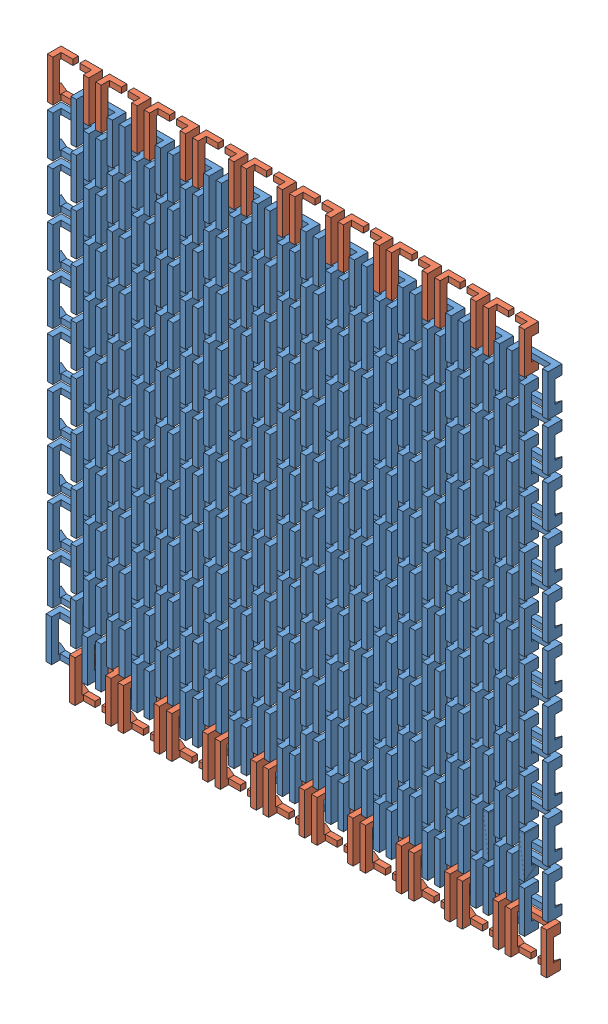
SolidWorks assembly Fabric2withhock.SLDASM, configuration Default (file format 10000). Lengths in mm.
Overall size (72.4 79.42 2.17).
223 component instances, 2 part files, 18 mates.
Components (placement in the parent):
- fabric1-1: fabric1.SLDPRT [Default] at (0.3008 0.4192 2.1343) size (6 6 2)
- fabric1-2: fabric1.SLDPRT [Default] at (-3.0992 3.8192 2.1343) size (6 6 2)
- fabric1-3: fabric1.SLDPRT [Default] at (3.7008 -2.9808 2.1343) size (6 6 2) (suppressed, hidden)
- fabric1-4: fabric1.SLDPRT [Default] at (-3.0992 -2.9808 2.1343) size (6 6 2)
- fabric1-5: fabric1.SLDPRT [Default] at (3.7008 3.8192 2.1343) size (6 6 2) (suppressed, hidden)
- fabric1-6: fabric1.SLDPRT [Default] at (0.3008 7.4192 2.1343) size (6 6 2)
- fabric1-7: fabric1.SLDPRT [Default] at (-6.6992 0.4192 2.1343) size (6 6 2)
- fabric1-8: fabric1.SLDPRT [Default] at (-6.6992 7.4192 2.1343) size (6 6 2)
- fabric1-29: fabric1.SLDPRT [Default] at (0.3008 14.4192 2.1343) size (6 6 2)
- fabric1-30: fabric1.SLDPRT [Default] at (-6.6992 14.4192 2.1343) size (6 6 2)
- fabric1-31: fabric1.SLDPRT [Default] at (-13.6992 0.4192 2.1343) size (6 6 2)
- fabric1-32: fabric1.SLDPRT [Default] at (-13.6992 7.4192 2.1343) size (6 6 2)
- fabric1-33: fabric1.SLDPRT [Default] at (-13.6992 14.4192 2.1343) size (6 6 2)
- fabric1-144: fabric1.SLDPRT [Default] at (0.3008 21.4192 2.1343) size (6 6 2)
- fabric1-145: fabric1.SLDPRT [Default] at (0.3008 28.4192 2.1343) size (6 6 2)
- fabric1-146: fabric1.SLDPRT [Default] at (0.3008 35.4192 2.1343) size (6 6 2)
- fabric1-147: fabric1.SLDPRT [Default] at (0.3008 42.4192 2.1343) size (6 6 2)
- fabric1-148: fabric1.SLDPRT [Default] at (0.3008 49.4192 2.1343) size (6 6 2)
- fabric1-149: fabric1.SLDPRT [Default] at (0.3008 56.4192 2.1343) size (6 6 2)
- fabric1-150: fabric1.SLDPRT [Default] at (0.3008 63.4192 2.1343) size (6 6 2)
- fabric1-151: fabric1.SLDPRT [Default] at (-6.6992 21.4192 2.1343) size (6 6 2)
- fabric1-152: fabric1.SLDPRT [Default] at (-6.6992 28.4192 2.1343) size (6 6 2)
- fabric1-153: fabric1.SLDPRT [Default] at (-6.6992 35.4192 2.1343) size (6 6 2)
- fabric1-154: fabric1.SLDPRT [Default] at (-6.6992 42.4192 2.1343) size (6 6 2)
- fabric1-155: fabric1.SLDPRT [Default] at (-6.6992 49.4192 2.1343) size (6 6 2)
- fabric1-156: fabric1.SLDPRT [Default] at (-6.6992 56.4192 2.1343) size (6 6 2)
- fabric1-157: fabric1.SLDPRT [Default] at (-6.6992 63.4192 2.1343) size (6 6 2)
- fabric1-158: fabric1.SLDPRT [Default] at (-13.6992 21.4192 2.1343) size (6 6 2)
- fabric1-159: fabric1.SLDPRT [Default] at (-13.6992 28.4192 2.1343) size (6 6 2)
- fabric1-160: fabric1.SLDPRT [Default] at (-13.6992 35.4192 2.1343) size (6 6 2)
- fabric1-161: fabric1.SLDPRT [Default] at (-13.6992 42.4192 2.1343) size (6 6 2)
- fabric1-162: fabric1.SLDPRT [Default] at (-13.6992 49.4192 2.1343) size (6 6 2)
- fabric1-163: fabric1.SLDPRT [Default] at (-13.6992 56.4192 2.1343) size (6 6 2)
- fabric1-164: fabric1.SLDPRT [Default] at (-13.6992 63.4192 2.1343) size (6 6 2)
- fabric1-165: fabric1.SLDPRT [Default] at (-20.6992 0.4192 2.1343) size (6 6 2)
- fabric1-166: fabric1.SLDPRT [Default] at (-20.6992 7.4192 2.1343) size (6 6 2)
- fabric1-167: fabric1.SLDPRT [Default] at (-20.6992 14.4192 2.1343) size (6 6 2)
- fabric1-168: fabric1.SLDPRT [Default] at (-20.6992 21.4192 2.1343) size (6 6 2)
- fabric1-169: fabric1.SLDPRT [Default] at (-20.6992 28.4192 2.1343) size (6 6 2)
- fabric1-170: fabric1.SLDPRT [Default] at (-20.6992 35.4192 2.1343) size (6 6 2)
- fabric1-171: fabric1.SLDPRT [Default] at (-20.6992 42.4192 2.1343) size (6 6 2)
- fabric1-172: fabric1.SLDPRT [Default] at (-20.6992 49.4192 2.1343) size (6 6 2)
- fabric1-173: fabric1.SLDPRT [Default] at (-20.6992 56.4192 2.1343) size (6 6 2)
- fabric1-174: fabric1.SLDPRT [Default] at (-20.6992 63.4192 2.1343) size (6 6 2)
- fabric1-175: fabric1.SLDPRT [Default] at (-27.6992 0.4192 2.1343) size (6 6 2)
- fabric1-176: fabric1.SLDPRT [Default] at (-27.6992 7.4192 2.1343) size (6 6 2)
- fabric1-177: fabric1.SLDPRT [Default] at (-27.6992 14.4192 2.1343) size (6 6 2)
- fabric1-178: fabric1.SLDPRT [Default] at (-27.6992 21.4192 2.1343) size (6 6 2)
- fabric1-179: fabric1.SLDPRT [Default] at (-27.6992 28.4192 2.1343) size (6 6 2)
- fabric1-180: fabric1.SLDPRT [Default] at (-27.6992 35.4192 2.1343) size (6 6 2)
- fabric1-181: fabric1.SLDPRT [Default] at (-27.6992 42.4192 2.1343) size (6 6 2)
- fabric1-182: fabric1.SLDPRT [Default] at (-27.6992 49.4192 2.1343) size (6 6 2)
- fabric1-183: fabric1.SLDPRT [Default] at (-27.6992 56.4192 2.1343) size (6 6 2)
- fabric1-184: fabric1.SLDPRT [Default] at (-27.6992 63.4192 2.1343) size (6 6 2)
- fabric1-185: fabric1.SLDPRT [Default] at (-34.6992 0.4192 2.1343) size (6 6 2)
- fabric1-186: fabric1.SLDPRT [Default] at (-34.6992 7.4192 2.1343) size (6 6 2)
- fabric1-187: fabric1.SLDPRT [Default] at (-34.6992 14.4192 2.1343) size (6 6 2)
- fabric1-188: fabric1.SLDPRT [Default] at (-34.6992 21.4192 2.1343) size (6 6 2)
- fabric1-189: fabric1.SLDPRT [Default] at (-34.6992 28.4192 2.1343) size (6 6 2)
- fabric1-190: fabric1.SLDPRT [Default] at (-34.6992 35.4192 2.1343) size (6 6 2)
- fabric1-191: fabric1.SLDPRT [Default] at (-34.6992 42.4192 2.1343) size (6 6 2)
- fabric1-192: fabric1.SLDPRT [Default] at (-34.6992 49.4192 2.1343) size (6 6 2)
- fabric1-193: fabric1.SLDPRT [Default] at (-34.6992 56.4192 2.1343) size (6 6 2)
- fabric1-194: fabric1.SLDPRT [Default] at (-34.6992 63.4192 2.1343) size (6 6 2)
- fabric1-195: fabric1.SLDPRT [Default] at (-41.6992 0.4192 2.1343) size (6 6 2)
- fabric1-196: fabric1.SLDPRT [Default] at (-41.6992 7.4192 2.1343) size (6 6 2)
- fabric1-197: fabric1.SLDPRT [Default] at (-41.6992 14.4192 2.1343) size (6 6 2)
- fabric1-198: fabric1.SLDPRT [Default] at (-41.6992 21.4192 2.1343) size (6 6 2)
- fabric1-199: fabric1.SLDPRT [Default] at (-41.6992 28.4192 2.1343) size (6 6 2)
- fabric1-200: fabric1.SLDPRT [Default] at (-41.6992 35.4192 2.1343) size (6 6 2)
- fabric1-201: fabric1.SLDPRT [Default] at (-41.6992 42.4192 2.1343) size (6 6 2)
- fabric1-202: fabric1.SLDPRT [Default] at (-41.6992 49.4192 2.1343) size (6 6 2)
- fabric1-203: fabric1.SLDPRT [Default] at (-41.6992 56.4192 2.1343) size (6 6 2)
- fabric1-204: fabric1.SLDPRT [Default] at (-41.6992 63.4192 2.1343) size (6 6 2)
- fabric1-205: fabric1.SLDPRT [Default] at (-48.6992 0.4192 2.1343) size (6 6 2)
- fabric1-206: fabric1.SLDPRT [Default] at (-48.6992 7.4192 2.1343) size (6 6 2)
- fabric1-207: fabric1.SLDPRT [Default] at (-48.6992 14.4192 2.1343) size (6 6 2)
- fabric1-208: fabric1.SLDPRT [Default] at (-48.6992 21.4192 2.1343) size (6 6 2)
- fabric1-209: fabric1.SLDPRT [Default] at (-48.6992 28.4192 2.1343) size (6 6 2)
- fabric1-210: fabric1.SLDPRT [Default] at (-48.6992 35.4192 2.1343) size (6 6 2)
- fabric1-211: fabric1.SLDPRT [Default] at (-48.6992 42.4192 2.1343) size (6 6 2)
- fabric1-212: fabric1.SLDPRT [Default] at (-48.6992 49.4192 2.1343) size (6 6 2)
- fabric1-213: fabric1.SLDPRT [Default] at (-48.6992 56.4192 2.1343) size (6 6 2)
- fabric1-214: fabric1.SLDPRT [Default] at (-48.6992 63.4192 2.1343) size (6 6 2)
- fabric1-215: fabric1.SLDPRT [Default] at (-55.6992 0.4192 2.1343) size (6 6 2)
- fabric1-216: fabric1.SLDPRT [Default] at (-55.6992 7.4192 2.1343) size (6 6 2)
- fabric1-217: fabric1.SLDPRT [Default] at (-55.6992 14.4192 2.1343) size (6 6 2)
- fabric1-218: fabric1.SLDPRT [Default] at (-55.6992 21.4192 2.1343) size (6 6 2)
- fabric1-219: fabric1.SLDPRT [Default] at (-55.6992 28.4192 2.1343) size (6 6 2)
- fabric1-220: fabric1.SLDPRT [Default] at (-55.6992 35.4192 2.1343) size (6 6 2)
- fabric1-221: fabric1.SLDPRT [Default] at (-55.6992 42.4192 2.1343) size (6 6 2)
- fabric1-222: fabric1.SLDPRT [Default] at (-55.6992 49.4192 2.1343) size (6 6 2)
- fabric1-223: fabric1.SLDPRT [Default] at (-55.6992 56.4192 2.1343) size (6 6 2)
- fabric1-224: fabric1.SLDPRT [Default] at (-55.6992 63.4192 2.1343) size (6 6 2)
- fabric1-225: fabric1.SLDPRT [Default] at (-62.7187 0.5943 2.1343) size (6 6 2)
- fabric1-226: fabric1.SLDPRT [Default] at (-62.6992 7.4192 2.1343) size (6 6 2)
- fabric1-227: fabric1.SLDPRT [Default] at (-62.6992 14.4192 2.1343) size (6 6 2)
- fabric1-228: fabric1.SLDPRT [Default] at (-62.6992 21.4192 2.1343) size (6 6 2)
- fabric1-229: fabric1.SLDPRT [Default] at (-62.6992 28.4192 2.1343) size (6 6 2)
- fabric1-230: fabric1.SLDPRT [Default] at (-62.6992 35.4192 2.1343) size (6 6 2)
- fabric1-231: fabric1.SLDPRT [Default] at (-62.6992 42.4192 2.1343) size (6 6 2)
- fabric1-232: fabric1.SLDPRT [Default] at (-62.6992 49.4192 2.1343) size (6 6 2)
- fabric1-233: fabric1.SLDPRT [Default] at (-62.6992 56.4192 2.1343) size (6 6 2)
- fabric1-234: fabric1.SLDPRT [Default] at (-62.6992 63.4192 2.1343) size (6 6 2)
- fabric1-963: fabric1.SLDPRT [Default] at (-10.0992 -2.9808 2.1343) size (6 6 2)
- fabric1-964: fabric1.SLDPRT [Default] at (-17.0992 -2.9808 2.1343) size (6 6 2)
- fabric1-965: fabric1.SLDPRT [Default] at (-24.0992 -2.9808 2.1343) size (6 6 2)
- fabric1-966: fabric1.SLDPRT [Default] at (-31.0992 -2.9808 2.1343) size (6 6 2)
- fabric1-967: fabric1.SLDPRT [Default] at (-38.0992 -2.9808 2.1343) size (6 6 2)
- fabric1-968: fabric1.SLDPRT [Default] at (-45.0992 -2.9808 2.1343) size (6 6 2)
- fabric1-969: fabric1.SLDPRT [Default] at (-52.0992 -2.9808 2.1343) size (6 6 2)
- fabric1-970: fabric1.SLDPRT [Default] at (-59.0992 -2.9808 2.1343) size (6 6 2)
- fabric1-971: fabric1.SLDPRT [Default] at (-66.0992 -2.9808 2.3014) size (6 6 2)
- fabric1-982: fabric1.SLDPRT [Default] at (-3.0992 4.0192 2.1343) size (6 6 2)
- fabric1-983: fabric1.SLDPRT [Default] at (-10.0992 4.0192 2.1343) size (6 6 2)
- fabric1-984: fabric1.SLDPRT [Default] at (-17.0992 4.0192 2.1343) size (6 6 2)
- fabric1-985: fabric1.SLDPRT [Default] at (-24.0992 4.0192 2.1343) size (6 6 2)
- fabric1-986: fabric1.SLDPRT [Default] at (-31.0992 4.0192 2.1343) size (6 6 2)
- fabric1-987: fabric1.SLDPRT [Default] at (-38.0992 4.0192 2.1343) size (6 6 2)
- fabric1-988: fabric1.SLDPRT [Default] at (-45.0992 4.0192 2.1343) size (6 6 2)
- fabric1-989: fabric1.SLDPRT [Default] at (-52.0992 4.0192 2.1343) size (6 6 2)
- fabric1-990: fabric1.SLDPRT [Default] at (-59.0992 4.0192 2.1343) size (6 6 2)
- fabric1-991: fabric1.SLDPRT [Default] at (-66.0992 4.0192 2.1343) size (6 6 2)
- fabric1-1002: fabric1.SLDPRT [Default] at (-3.0992 11.0192 2.1343) size (6 6 2)
- fabric1-1003: fabric1.SLDPRT [Default] at (-10.0992 11.0192 2.1343) size (6 6 2)
- fabric1-1004: fabric1.SLDPRT [Default] at (-17.0992 11.0192 2.1343) size (6 6 2)
- fabric1-1005: fabric1.SLDPRT [Default] at (-24.0992 11.0192 2.1343) size (6 6 2)
- fabric1-1006: fabric1.SLDPRT [Default] at (-31.0992 11.0192 2.1343) size (6 6 2)
- fabric1-1007: fabric1.SLDPRT [Default] at (-38.0992 11.0192 2.1343) size (6 6 2)
- fabric1-1008: fabric1.SLDPRT [Default] at (-45.0992 11.0192 2.1343) size (6 6 2)
- fabric1-1009: fabric1.SLDPRT [Default] at (-52.0992 11.0192 2.1343) size (6 6 2)
- fabric1-1010: fabric1.SLDPRT [Default] at (-59.0992 11.0192 2.1343) size (6 6 2)
- fabric1-1011: fabric1.SLDPRT [Default] at (-66.0992 11.0192 2.1343) size (6 6 2)
- fabric1-1022: fabric1.SLDPRT [Default] at (-3.0992 18.0192 2.1343) size (6 6 2)
- fabric1-1023: fabric1.SLDPRT [Default] at (-10.0992 18.0192 2.1343) size (6 6 2)
- fabric1-1024: fabric1.SLDPRT [Default] at (-17.0992 18.0192 2.1343) size (6 6 2)
- fabric1-1025: fabric1.SLDPRT [Default] at (-24.0992 18.0192 2.1343) size (6 6 2)
- fabric1-1026: fabric1.SLDPRT [Default] at (-31.0992 18.0192 2.1343) size (6 6 2)
- fabric1-1027: fabric1.SLDPRT [Default] at (-38.0992 18.0192 2.1343) size (6 6 2)
- fabric1-1028: fabric1.SLDPRT [Default] at (-45.0992 18.0192 2.1343) size (6 6 2)
- fabric1-1029: fabric1.SLDPRT [Default] at (-52.0992 18.0192 2.1343) size (6 6 2)
- fabric1-1030: fabric1.SLDPRT [Default] at (-59.0992 18.0192 2.1343) size (6 6 2)
- fabric1-1031: fabric1.SLDPRT [Default] at (-66.0992 18.0192 2.1343) size (6 6 2)
- fabric1-1042: fabric1.SLDPRT [Default] at (-3.0992 25.0192 2.1343) size (6 6 2)
- fabric1-1043: fabric1.SLDPRT [Default] at (-10.0992 25.0192 2.1343) size (6 6 2)
- fabric1-1044: fabric1.SLDPRT [Default] at (-17.0992 25.0192 2.1343) size (6 6 2)
- fabric1-1045: fabric1.SLDPRT [Default] at (-24.0992 25.0192 2.1343) size (6 6 2)
- fabric1-1046: fabric1.SLDPRT [Default] at (-31.0992 25.0192 2.1343) size (6 6 2)
- fabric1-1047: fabric1.SLDPRT [Default] at (-38.0992 25.0192 2.1343) size (6 6 2)
- fabric1-1048: fabric1.SLDPRT [Default] at (-45.0992 25.0192 2.1343) size (6 6 2)
- fabric1-1049: fabric1.SLDPRT [Default] at (-52.0992 25.0192 2.1343) size (6 6 2)
- fabric1-1050: fabric1.SLDPRT [Default] at (-59.0992 25.0192 2.1343) size (6 6 2)
- fabric1-1051: fabric1.SLDPRT [Default] at (-66.0992 25.0192 2.1343) size (6 6 2)
- fabric1-1062: fabric1.SLDPRT [Default] at (-3.0992 32.0192 2.1343) size (6 6 2)
- fabric1-1063: fabric1.SLDPRT [Default] at (-10.0992 32.0192 2.1343) size (6 6 2)
- fabric1-1064: fabric1.SLDPRT [Default] at (-17.0992 32.0192 2.1343) size (6 6 2)
- fabric1-1065: fabric1.SLDPRT [Default] at (-24.0992 32.0192 2.1343) size (6 6 2)
- fabric1-1066: fabric1.SLDPRT [Default] at (-31.0992 32.0192 2.1343) size (6 6 2)
- fabric1-1067: fabric1.SLDPRT [Default] at (-38.0992 32.0192 2.1343) size (6 6 2)
- fabric1-1068: fabric1.SLDPRT [Default] at (-45.0992 32.0192 2.1343) size (6 6 2)
- fabric1-1069: fabric1.SLDPRT [Default] at (-52.0992 32.0192 2.1343) size (6 6 2)
- fabric1-1070: fabric1.SLDPRT [Default] at (-59.0992 32.0192 2.1343) size (6 6 2)
- fabric1-1071: fabric1.SLDPRT [Default] at (-66.0992 32.0192 2.1343) size (6 6 2)
- fabric1-1082: fabric1.SLDPRT [Default] at (-3.0992 39.0192 2.1343) size (6 6 2)
- fabric1-1083: fabric1.SLDPRT [Default] at (-10.0992 39.0192 2.1343) size (6 6 2)
- fabric1-1084: fabric1.SLDPRT [Default] at (-17.0992 39.0192 2.1343) size (6 6 2)
- fabric1-1085: fabric1.SLDPRT [Default] at (-24.0992 39.0192 2.1343) size (6 6 2)
- fabric1-1086: fabric1.SLDPRT [Default] at (-31.0992 39.0192 2.1343) size (6 6 2)
- fabric1-1087: fabric1.SLDPRT [Default] at (-38.0992 39.0192 2.1343) size (6 6 2)
- fabric1-1088: fabric1.SLDPRT [Default] at (-45.0992 39.0192 2.1343) size (6 6 2)
- fabric1-1089: fabric1.SLDPRT [Default] at (-52.0992 39.0192 2.1343) size (6 6 2)
- fabric1-1090: fabric1.SLDPRT [Default] at (-59.0992 39.0192 2.1343) size (6 6 2)
- fabric1-1091: fabric1.SLDPRT [Default] at (-66.0992 39.0192 2.1343) size (6 6 2)
- fabric1-1102: fabric1.SLDPRT [Default] at (-3.0992 46.0192 2.1343) size (6 6 2)
- fabric1-1103: fabric1.SLDPRT [Default] at (-10.0992 46.0192 2.1343) size (6 6 2)
- fabric1-1104: fabric1.SLDPRT [Default] at (-17.0992 46.0192 2.1343) size (6 6 2)
- fabric1-1105: fabric1.SLDPRT [Default] at (-24.0992 46.0192 2.1343) size (6 6 2)
- fabric1-1106: fabric1.SLDPRT [Default] at (-31.0992 46.0192 2.1343) size (6 6 2)
- fabric1-1107: fabric1.SLDPRT [Default] at (-38.0992 46.0192 2.1343) size (6 6 2)
- fabric1-1108: fabric1.SLDPRT [Default] at (-45.0992 46.0192 2.1343) size (6 6 2)
- fabric1-1109: fabric1.SLDPRT [Default] at (-52.0992 46.0192 2.1343) size (6 6 2)
- fabric1-1110: fabric1.SLDPRT [Default] at (-59.0992 46.0192 2.1343) size (6 6 2)
- fabric1-1111: fabric1.SLDPRT [Default] at (-66.0992 46.0192 2.1343) size (6 6 2)
- fabric1-1122: fabric1.SLDPRT [Default] at (-3.0992 53.0192 2.1343) size (6 6 2)
- fabric1-1123: fabric1.SLDPRT [Default] at (-10.0992 53.0192 2.1343) size (6 6 2)
- fabric1-1124: fabric1.SLDPRT [Default] at (-17.0992 53.0192 2.1343) size (6 6 2)
- fabric1-1125: fabric1.SLDPRT [Default] at (-24.0992 53.0192 2.1343) size (6 6 2)
- fabric1-1126: fabric1.SLDPRT [Default] at (-31.0992 53.0192 2.1343) size (6 6 2)
- fabric1-1127: fabric1.SLDPRT [Default] at (-38.0992 53.0192 2.1343) size (6 6 2)
- fabric1-1128: fabric1.SLDPRT [Default] at (-45.0992 53.0192 2.1343) size (6 6 2)
- fabric1-1129: fabric1.SLDPRT [Default] at (-52.0992 53.0192 2.1343) size (6 6 2)
- fabric1-1130: fabric1.SLDPRT [Default] at (-59.0992 53.0192 2.1343) size (6 6 2)
- fabric1-1131: fabric1.SLDPRT [Default] at (-66.0992 53.0192 2.1343) size (6 6 2)
- fabric1-1142: fabric1.SLDPRT [Default] at (-3.0992 60.0192 2.1343) size (6 6 2)
- fabric1-1143: fabric1.SLDPRT [Default] at (-10.0992 60.0192 2.1343) size (6 6 2)
- fabric1-1144: fabric1.SLDPRT [Default] at (-17.0992 60.0192 2.1343) size (6 6 2)
- fabric1-1145: fabric1.SLDPRT [Default] at (-24.0992 60.0192 2.1343) size (6 6 2)
- fabric1-1146: fabric1.SLDPRT [Default] at (-31.0992 60.0192 2.1343) size (6 6 2)
- fabric1-1147: fabric1.SLDPRT [Default] at (-38.0992 60.0192 2.1343) size (6 6 2)
- fabric1-1148: fabric1.SLDPRT [Default] at (-45.0992 60.0192 2.1343) size (6 6 2)
- fabric1-1149: fabric1.SLDPRT [Default] at (-52.0992 60.0192 2.1343) size (6 6 2)
- fabric1-1150: fabric1.SLDPRT [Default] at (-59.0992 60.0192 2.1343) size (6 6 2)
- fabric1-1151: fabric1.SLDPRT [Default] at (-66.0992 60.0192 2.1343) size (6 6 2)
- fabrichock-2: fabrichock.SLDPRT [Default] at (2.9008 73.0192 2.1343) x (-1 0 0) z (0 0 1) size (6 6 2)
- fabrichock-3: fabrichock.SLDPRT [Default] at (-4.0992 73.0192 2.1343) x (-1 0 0) z (0 0 1) size (6 6 2)
- fabrichock-4: fabrichock.SLDPRT [Default] at (-11.0992 73.0192 2.1343) x (-1 0 0) z (0 0 1) size (6 6 2)
- fabrichock-5: fabrichock.SLDPRT [Default] at (-18.0992 73.0192 2.1343) x (-1 0 0) z (0 0 1) size (6 6 2)
- fabrichock-6: fabrichock.SLDPRT [Default] at (-25.0992 73.0192 2.1343) x (-1 0 0) z (0 0 1) size (6 6 2)
- fabrichock-7: fabrichock.SLDPRT [Default] at (-32.0992 73.0192 2.1343) x (-1 0 0) z (0 0 1) size (6 6 2)
- fabrichock-8: fabrichock.SLDPRT [Default] at (-39.0992 73.0192 2.1343) x (-1 0 0) z (0 0 1) size (6 6 2)
- fabrichock-9: fabrichock.SLDPRT [Default] at (-46.0992 73.0192 2.1343) x (-1 0 0) z (0 0 1) size (6 6 2)
- fabrichock-10: fabrichock.SLDPRT [Default] at (-53.0992 73.0192 2.1343) x (-1 0 0) z (0 0 1) size (6 6 2)
- fabrichock-11: fabrichock.SLDPRT [Default] at (-60.0992 73.0192 2.1343) x (-1 0 0) z (0 0 1) size (6 6 2)
- fabrichock-12: fabrichock.SLDPRT [Default] at (-62.7187 -6.4057 2.3014) size (6 6 2)
- fabrichock-13: fabrichock.SLDPRT [Default] at (-55.7187 -6.4057 2.3014) size (6 6 2)
- fabrichock-14: fabrichock.SLDPRT [Default] at (-48.7187 -6.4057 2.3014) size (6 6 2)
- fabrichock-15: fabrichock.SLDPRT [Default] at (-41.7187 -6.4057 2.3014) size (6 6 2)
- fabrichock-16: fabrichock.SLDPRT [Default] at (-34.7187 -6.4057 2.3014) size (6 6 2)
- fabrichock-17: fabrichock.SLDPRT [Default] at (-27.7187 -6.4057 2.3014) size (6 6 2)
- fabrichock-18: fabrichock.SLDPRT [Default] at (-20.7187 -6.4057 2.3014) size (6 6 2)
- fabrichock-19: fabrichock.SLDPRT [Default] at (-13.7187 -6.4057 2.3014) size (6 6 2)
- fabrichock-20: fabrichock.SLDPRT [Default] at (-6.7187 -6.4057 2.3014) size (6 6 2)
- fabrichock-21: fabrichock.SLDPRT [Default] at (0.2813 -6.4057 2.3014) size (6 6 2)
Mates (geometry in assembly coordinates):
- Coincident3: coincident aligned: plane of fabric1-2 through (-3.0992 3.8192 4.1343) normal (0 0 1); plane of fabric1-3 through (3.7008 -2.9808 4.1343) normal (0 0 1)
- Coincident4: coincident aligned: plane of fabric1-4 through (-3.0992 -2.9808 4.1343) normal (0 0 1); plane of fabric1-5 through (3.7008 3.8192 4.1343) normal (0 0 1)
- Coincident5: coincident aligned: plane of fabric1-3 through (3.7008 -2.9808 4.1343) normal (0 0 1); plane of fabric1-4 through (-3.0992 -2.9808 4.1343) normal (0 0 1)
- Coincident7: coincident aligned: plane of fabric1-2 through (-3.0992 3.8192 4.1343) normal (-1 0 0); plane of fabric1-4 through (-3.0992 -2.9808 4.1343) normal (-1 0 0)
- Coincident8: coincident aligned: plane of fabric1-2 through (-3.0992 9.8192 4.1343) normal (0 1 0); plane of fabric1-5 through (3.7008 9.8192 4.1343) normal (0 1 0)
- Coincident9: coincident aligned: plane of fabric1-3 through (9.7008 -2.9808 4.1343) normal (1 0 0); plane of fabric1-5 through (9.7008 3.8192 4.1343) normal (1 0 0)
- Coincident10: coincident aligned: plane of fabric1-3 through (3.7008 -2.9808 4.1343) normal (0 -1 0); plane of fabric1-4 through (-3.0992 -2.9808 4.1343) normal (0 -1 0)
- Coincident12: coincident aligned: plane of fabric1-1 through (0.3008 0.4192 2.1343) normal (0 0 -1); plane of fabric1-4 through (-3.0992 -2.9808 2.1343) normal (0 0 -1)
- Distance2: distance = 0.8 mm anti-aligned: plane of fabric1-5 through (3.7008 3.8192 4.1343) normal (-1 0 0); plane of fabric1-2 through (2.9008 3.8192 4.1343) normal (1 0 0)
- Distance3: distance = 0.8 mm anti-aligned: plane of fabric1-2 through (-3.0992 3.8192 4.1343) normal (0 -1 0); plane of fabric1-4 through (-3.0992 3.0192 4.1343) normal (0 1 0)
- Width1: width anti-aligned: plane of ? through (12.5008 1.2192 4.1343) normal (-1 0 0); plane of fabric1-7 through (-5.8992 1.2192 4.1343) normal (1 0 0); plane of fabric1-5 through (9.7008 3.8192 4.1343) normal (1 0 0); plane of fabric1-2 through (-3.0992 3.8192 4.1343) normal (-1 0 0)
- Width2: width aligned: plane of ? through (5.5008 -5.7808 3.1343) normal (0 1 0); plane of fabric1-6 through (5.5008 12.6192 3.1343) normal (0 -1 0); plane of fabric1-5 through (3.7008 9.8192 4.1343) normal (0 1 0); plane of fabric1-3 through (3.7008 -2.9808 4.1343) normal (0 -1 0)
- Coincident15: coincident aligned: plane of fabric1-1151 through (-66.0992 60.0192 2.1343) normal (0 0 -1); plane of fabrichock-2 through (2.9008 73.0192 2.1343) normal (0 0 -1)
- Distance6: distance = 1 mm anti-aligned: plane of fabrichock-2 through (2.9008 67.0192 4.1343) normal (0 -1 0); plane of fabric1-1151 through (-66.0992 66.0192 4.1343) normal (0 1 0)
- Coincident18: coincident aligned: plane of fabrichock-2 through (2.9008 73.0192 4.1343) normal (1 0 0); plane of fabric1-1142 through (2.9008 60.0192 4.1343) normal (1 0 0)
- Coincident19: coincident aligned: plane of fabric1-971 through (-66.0992 -2.9808 2.3014) normal (0 0 -1); plane of fabrichock-12 through (-62.7187 -6.4057 2.3014) normal (0 0 -1)
- Coincident20: coincident aligned: plane of fabric1-225 through (-62.7187 0.5943 4.1343) normal (-1 0 0); plane of fabrichock-12 through (-62.7187 -6.4057 4.3014) normal (-1 0 0)
- Distance9: distance = 1 mm anti-aligned: plane of fabrichock-12 through (-62.7187 -0.4057 4.3014) normal (0 1 0); plane of fabric1-225 through (-62.7187 0.5943 4.1343) normal (0 -1 0)
